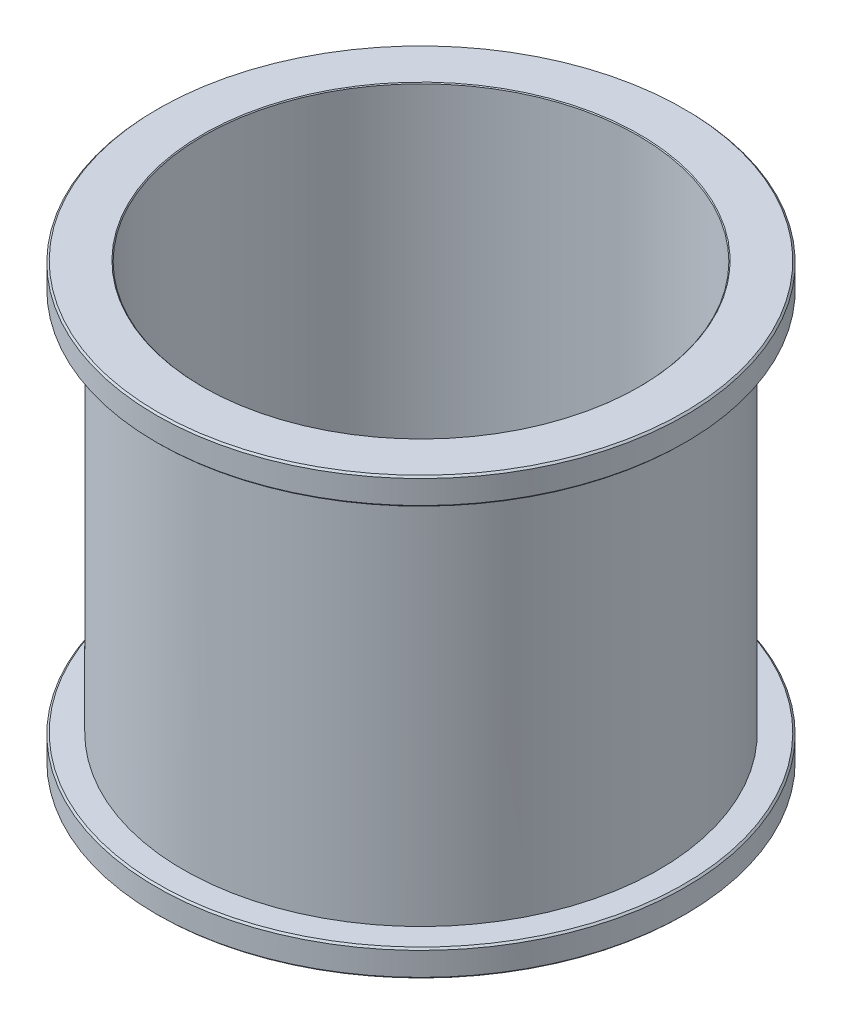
ISO-10303-21;
HEADER;
FILE_DESCRIPTION(('STEP AP214'),'2;1');
FILE_NAME('part.step','',(''),(''),'','','');
FILE_SCHEMA(('AUTOMOTIVE_DESIGN { 1 0 10303 214 1 1 1 1 }'));
ENDSEC;
DATA;
#1=APPLICATION_CONTEXT('core data for automotive mechanical design processes');
#2=APPLICATION_PROTOCOL_DEFINITION('international standard','automotive_design',2000,#1);
#3=PRODUCT_CONTEXT('',#1,'mechanical');
#4=PRODUCT('Part','Part','',(#3));
#5=PRODUCT_RELATED_PRODUCT_CATEGORY('part','',(#4));
#6=PRODUCT_DEFINITION_FORMATION('','',#4);
#7=PRODUCT_DEFINITION_CONTEXT('part definition',#1,'design');
#8=PRODUCT_DEFINITION('design','',#6,#7);
#9=PRODUCT_DEFINITION_SHAPE('','',#8);
#10=(LENGTH_UNIT() NAMED_UNIT(*) SI_UNIT(.MILLI.,.METRE.));
#11=(NAMED_UNIT(*) PLANE_ANGLE_UNIT() SI_UNIT($,.RADIAN.));
#12=(NAMED_UNIT(*) SI_UNIT($,.STERADIAN.) SOLID_ANGLE_UNIT());
#13=UNCERTAINTY_MEASURE_WITH_UNIT(LENGTH_MEASURE(1.E-05),#10,'distance_accuracy_value','');
#14=(GEOMETRIC_REPRESENTATION_CONTEXT(3) GLOBAL_UNCERTAINTY_ASSIGNED_CONTEXT((#13)) GLOBAL_UNIT_ASSIGNED_CONTEXT((#10,
#11,#12)) REPRESENTATION_CONTEXT('',''));
#15=CARTESIAN_POINT('',(0.,0.,0.));
#16=DIRECTION('',(0.,0.,1.));
#17=DIRECTION('',(1.,0.,0.));
#18=AXIS2_PLACEMENT_3D('',#15,#16,#17);
#19=CARTESIAN_POINT('',(0.,130.,0.));
#20=DIRECTION('',(0.,-1.,0.));
#21=DIRECTION('',(0.,0.,-1.));
#22=AXIS2_PLACEMENT_3D('',#19,#20,#21);
#23=CYLINDRICAL_SURFACE('',#22,71.);
#24=CARTESIAN_POINT('',(0.,122.,0.));
#25=DIRECTION('',(0.,1.,0.));
#26=DIRECTION('',(0.,0.,1.));
#27=AXIS2_PLACEMENT_3D('',#24,#25,#26);
#28=CIRCLE('',#27,71.);
#29=CARTESIAN_POINT('',(0.,122.,71.));
#30=VERTEX_POINT('',#29);
#31=EDGE_CURVE('E109',#30,#30,#28,.T.);
#32=ORIENTED_EDGE('',*,*,#31,.F.);
#33=EDGE_LOOP('',(#32));
#34=FACE_BOUND('',#33,.T.);
#35=CARTESIAN_POINT('',(0.,8.00000000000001,0.));
#36=DIRECTION('',(0.,-1.,0.));
#37=DIRECTION('',(0.,0.,-1.));
#38=AXIS2_PLACEMENT_3D('',#35,#36,#37);
#39=CIRCLE('',#38,71.);
#40=CARTESIAN_POINT('',(0.,8.00000000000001,-71.));
#41=VERTEX_POINT('',#40);
#42=EDGE_CURVE('E105',#41,#41,#39,.T.);
#43=ORIENTED_EDGE('',*,*,#42,.F.);
#44=EDGE_LOOP('',(#43));
#45=FACE_BOUND('',#44,.T.);
#46=ADVANCED_FACE('F47',(#34,#45),#23,.T.);
#47=CARTESIAN_POINT('',(0.,130.,0.));
#48=DIRECTION('',(0.,1.,0.));
#49=DIRECTION('',(0.,0.,1.));
#50=AXIS2_PLACEMENT_3D('',#47,#48,#49);
#51=PLANE('',#50);
#52=CARTESIAN_POINT('',(0.,130.,0.));
#53=DIRECTION('',(0.,1.,0.));
#54=DIRECTION('',(0.,0.,1.));
#55=AXIS2_PLACEMENT_3D('',#52,#53,#54);
#56=CIRCLE('',#55,65.254);
#57=CARTESIAN_POINT('',(0.,130.,65.254));
#58=VERTEX_POINT('',#57);
#59=EDGE_CURVE('E10',#58,#58,#56,.F.);
#60=ORIENTED_EDGE('',*,*,#59,.T.);
#61=EDGE_LOOP('',(#60));
#62=FACE_BOUND('',#61,.T.);
#63=CARTESIAN_POINT('',(0.,130.,0.));
#64=DIRECTION('',(0.,1.,0.));
#65=DIRECTION('',(0.,0.,1.));
#66=AXIS2_PLACEMENT_3D('',#63,#64,#65);
#67=CIRCLE('',#66,78.4919999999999);
#68=CARTESIAN_POINT('',(0.,130.,78.4919999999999));
#69=VERTEX_POINT('',#68);
#70=EDGE_CURVE('E85',#69,#69,#67,.T.);
#71=ORIENTED_EDGE('',*,*,#70,.T.);
#72=EDGE_LOOP('',(#71));
#73=FACE_BOUND('',#72,.T.);
#74=ADVANCED_FACE('F119',(#62,#73),#51,.T.);
#75=CARTESIAN_POINT('',(0.,0.,0.));
#76=DIRECTION('',(0.,1.,0.));
#77=DIRECTION('',(0.,0.,1.));
#78=AXIS2_PLACEMENT_3D('',#75,#76,#77);
#79=PLANE('',#78);
#80=CARTESIAN_POINT('',(0.,0.,0.));
#81=DIRECTION('',(0.,1.,0.));
#82=DIRECTION('',(0.,0.,1.));
#83=AXIS2_PLACEMENT_3D('',#80,#81,#82);
#84=CIRCLE('',#83,65.254);
#85=CARTESIAN_POINT('',(0.,0.,-65.254));
#86=VERTEX_POINT('',#85);
#87=EDGE_CURVE('E67',#86,#86,#84,.T.);
#88=ORIENTED_EDGE('',*,*,#87,.T.);
#89=EDGE_LOOP('',(#88));
#90=FACE_BOUND('',#89,.T.);
#91=CARTESIAN_POINT('',(0.,0.,0.));
#92=DIRECTION('',(0.,1.,0.));
#93=DIRECTION('',(0.,0.,1.));
#94=AXIS2_PLACEMENT_3D('',#91,#92,#93);
#95=CIRCLE('',#94,78.4919999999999);
#96=CARTESIAN_POINT('',(0.,0.,78.4919999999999));
#97=VERTEX_POINT('',#96);
#98=EDGE_CURVE('E101',#97,#97,#95,.F.);
#99=ORIENTED_EDGE('',*,*,#98,.T.);
#100=EDGE_LOOP('',(#99));
#101=FACE_BOUND('',#100,.T.);
#102=ADVANCED_FACE('F149',(#90,#101),#79,.F.);
#103=CARTESIAN_POINT('',(0.,130.,0.));
#104=DIRECTION('',(0.,-1.,0.));
#105=DIRECTION('',(0.,0.,-1.));
#106=AXIS2_PLACEMENT_3D('',#103,#104,#105);
#107=CYLINDRICAL_SURFACE('',#106,65.);
#108=CARTESIAN_POINT('',(0.,0.25400000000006,0.));
#109=DIRECTION('',(0.,1.,0.));
#110=DIRECTION('',(0.,0.,1.));
#111=AXIS2_PLACEMENT_3D('',#108,#109,#110);
#112=CIRCLE('',#111,65.);
#113=CARTESIAN_POINT('',(0.,0.25400000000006,-65.));
#114=VERTEX_POINT('',#113);
#115=EDGE_CURVE('E55',#114,#114,#112,.F.);
#116=ORIENTED_EDGE('',*,*,#115,.T.);
#117=EDGE_LOOP('',(#116));
#118=FACE_BOUND('',#117,.T.);
#119=CARTESIAN_POINT('',(0.,129.746,0.));
#120=DIRECTION('',(0.,1.,0.));
#121=DIRECTION('',(0.,0.,1.));
#122=AXIS2_PLACEMENT_3D('',#119,#120,#121);
#123=CIRCLE('',#122,65.);
#124=CARTESIAN_POINT('',(0.,129.746,65.));
#125=VERTEX_POINT('',#124);
#126=EDGE_CURVE('E61',#125,#125,#123,.T.);
#127=ORIENTED_EDGE('',*,*,#126,.T.);
#128=EDGE_LOOP('',(#127));
#129=FACE_BOUND('',#128,.T.);
#130=ADVANCED_FACE('F145',(#118,#129),#107,.F.);
#131=CARTESIAN_POINT('',(0.,122.,0.));
#132=DIRECTION('',(0.,1.,0.));
#133=DIRECTION('',(0.,0.,1.));
#134=AXIS2_PLACEMENT_3D('',#131,#132,#133);
#135=CYLINDRICAL_SURFACE('',#134,79.);
#136=CARTESIAN_POINT('',(0.,129.492,0.));
#137=DIRECTION('',(0.,1.,0.));
#138=DIRECTION('',(0.,0.,1.));
#139=AXIS2_PLACEMENT_3D('',#136,#137,#138);
#140=CIRCLE('',#139,79.);
#141=CARTESIAN_POINT('',(0.,129.492,79.));
#142=VERTEX_POINT('',#141);
#143=EDGE_CURVE('E77',#142,#142,#140,.F.);
#144=ORIENTED_EDGE('',*,*,#143,.T.);
#145=EDGE_LOOP('',(#144));
#146=FACE_BOUND('',#145,.T.);
#147=CARTESIAN_POINT('',(0.,122.508,0.));
#148=DIRECTION('',(0.,1.,0.));
#149=DIRECTION('',(0.,0.,1.));
#150=AXIS2_PLACEMENT_3D('',#147,#148,#149);
#151=CIRCLE('',#150,79.);
#152=CARTESIAN_POINT('',(0.,122.508,79.));
#153=VERTEX_POINT('',#152);
#154=EDGE_CURVE('E81',#153,#153,#151,.T.);
#155=ORIENTED_EDGE('',*,*,#154,.T.);
#156=EDGE_LOOP('',(#155));
#157=FACE_BOUND('',#156,.T.);
#158=ADVANCED_FACE('F141',(#146,#157),#135,.T.);
#159=CARTESIAN_POINT('',(0.,122.,0.));
#160=DIRECTION('',(0.,1.,0.));
#161=DIRECTION('',(0.,0.,1.));
#162=AXIS2_PLACEMENT_3D('',#159,#160,#161);
#163=PLANE('',#162);
#164=CARTESIAN_POINT('',(0.,122.,0.));
#165=DIRECTION('',(0.,1.,0.));
#166=DIRECTION('',(0.,0.,1.));
#167=AXIS2_PLACEMENT_3D('',#164,#165,#166);
#168=CIRCLE('',#167,78.492);
#169=CARTESIAN_POINT('',(0.,122.,78.492));
#170=VERTEX_POINT('',#169);
#171=EDGE_CURVE('E73',#170,#170,#168,.F.);
#172=ORIENTED_EDGE('',*,*,#171,.T.);
#173=EDGE_LOOP('',(#172));
#174=FACE_BOUND('',#173,.T.);
#175=ORIENTED_EDGE('',*,*,#31,.T.);
#176=EDGE_LOOP('',(#175));
#177=FACE_BOUND('',#176,.T.);
#178=ADVANCED_FACE('F115',(#174,#177),#163,.F.);
#179=CARTESIAN_POINT('',(0.,8.,0.));
#180=DIRECTION('',(0.,-1.,0.));
#181=DIRECTION('',(0.,0.,-1.));
#182=AXIS2_PLACEMENT_3D('',#179,#180,#181);
#183=CYLINDRICAL_SURFACE('',#182,79.);
#184=CARTESIAN_POINT('',(0.,0.508000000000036,0.));
#185=DIRECTION('',(0.,1.,0.));
#186=DIRECTION('',(0.,0.,1.));
#187=AXIS2_PLACEMENT_3D('',#184,#185,#186);
#188=CIRCLE('',#187,79.);
#189=CARTESIAN_POINT('',(0.,0.508000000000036,79.));
#190=VERTEX_POINT('',#189);
#191=EDGE_CURVE('E93',#190,#190,#188,.T.);
#192=ORIENTED_EDGE('',*,*,#191,.T.);
#193=EDGE_LOOP('',(#192));
#194=FACE_BOUND('',#193,.T.);
#195=CARTESIAN_POINT('',(0.,7.49200000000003,0.));
#196=DIRECTION('',(0.,-1.,0.));
#197=DIRECTION('',(0.,0.,-1.));
#198=AXIS2_PLACEMENT_3D('',#195,#196,#197);
#199=CIRCLE('',#198,79.);
#200=CARTESIAN_POINT('',(0.,7.49200000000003,-79.));
#201=VERTEX_POINT('',#200);
#202=EDGE_CURVE('E97',#201,#201,#199,.T.);
#203=ORIENTED_EDGE('',*,*,#202,.T.);
#204=EDGE_LOOP('',(#203));
#205=FACE_BOUND('',#204,.T.);
#206=ADVANCED_FACE('F126',(#194,#205),#183,.T.);
#207=CARTESIAN_POINT('',(0.,8.,0.));
#208=DIRECTION('',(0.,-1.,0.));
#209=DIRECTION('',(0.,0.,-1.));
#210=AXIS2_PLACEMENT_3D('',#207,#208,#209);
#211=PLANE('',#210);
#212=CARTESIAN_POINT('',(0.,8.,0.));
#213=DIRECTION('',(0.,-1.,0.));
#214=DIRECTION('',(0.,0.,-1.));
#215=AXIS2_PLACEMENT_3D('',#212,#213,#214);
#216=CIRCLE('',#215,78.492);
#217=CARTESIAN_POINT('',(0.,8.,-78.492));
#218=VERTEX_POINT('',#217);
#219=EDGE_CURVE('E89',#218,#218,#216,.F.);
#220=ORIENTED_EDGE('',*,*,#219,.T.);
#221=EDGE_LOOP('',(#220));
#222=FACE_BOUND('',#221,.T.);
#223=ORIENTED_EDGE('',*,*,#42,.T.);
#224=EDGE_LOOP('',(#223));
#225=FACE_BOUND('',#224,.T.);
#226=ADVANCED_FACE('F123',(#222,#225),#211,.F.);
#227=CARTESIAN_POINT('',(0.,0.,0.));
#228=DIRECTION('',(0.,1.,0.));
#229=DIRECTION('',(0.,0.,1.));
#230=AXIS2_PLACEMENT_3D('',#227,#228,#229);
#231=CONICAL_SURFACE('',#230,78.4919999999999,0.785398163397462);
#232=ORIENTED_EDGE('',*,*,#191,.F.);
#233=EDGE_LOOP('',(#232));
#234=FACE_BOUND('',#233,.T.);
#235=ORIENTED_EDGE('',*,*,#98,.F.);
#236=EDGE_LOOP('',(#235));
#237=FACE_BOUND('',#236,.T.);
#238=ADVANCED_FACE('F125',(#234,#237),#231,.T.);
#239=CARTESIAN_POINT('',(0.,7.49200000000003,0.));
#240=DIRECTION('',(0.,-1.,0.));
#241=DIRECTION('',(0.,0.,-1.));
#242=AXIS2_PLACEMENT_3D('',#239,#240,#241);
#243=CONICAL_SURFACE('',#242,79.,0.785398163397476);
#244=ORIENTED_EDGE('',*,*,#219,.F.);
#245=EDGE_LOOP('',(#244));
#246=FACE_BOUND('',#245,.T.);
#247=ORIENTED_EDGE('',*,*,#202,.F.);
#248=EDGE_LOOP('',(#247));
#249=FACE_BOUND('',#248,.T.);
#250=ADVANCED_FACE('F133',(#246,#249),#243,.T.);
#251=CARTESIAN_POINT('',(0.,130.,0.));
#252=DIRECTION('',(0.,-1.,0.));
#253=DIRECTION('',(0.,0.,-1.));
#254=AXIS2_PLACEMENT_3D('',#251,#252,#253);
#255=CONICAL_SURFACE('',#254,78.4919999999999,0.785398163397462);
#256=ORIENTED_EDGE('',*,*,#143,.F.);
#257=EDGE_LOOP('',(#256));
#258=FACE_BOUND('',#257,.T.);
#259=ORIENTED_EDGE('',*,*,#70,.F.);
#260=EDGE_LOOP('',(#259));
#261=FACE_BOUND('',#260,.T.);
#262=ADVANCED_FACE('F157',(#258,#261),#255,.T.);
#263=CARTESIAN_POINT('',(0.,122.508,0.));
#264=DIRECTION('',(0.,1.,0.));
#265=DIRECTION('',(0.,0.,1.));
#266=AXIS2_PLACEMENT_3D('',#263,#264,#265);
#267=CONICAL_SURFACE('',#266,79.,0.785398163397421);
#268=ORIENTED_EDGE('',*,*,#171,.F.);
#269=EDGE_LOOP('',(#268));
#270=FACE_BOUND('',#269,.T.);
#271=ORIENTED_EDGE('',*,*,#154,.F.);
#272=EDGE_LOOP('',(#271));
#273=FACE_BOUND('',#272,.T.);
#274=ADVANCED_FACE('F161',(#270,#273),#267,.T.);
#275=CARTESIAN_POINT('',(0.,0.,0.));
#276=DIRECTION('',(0.,-1.,0.));
#277=DIRECTION('',(0.,0.,-1.));
#278=AXIS2_PLACEMENT_3D('',#275,#276,#277);
#279=CONICAL_SURFACE('',#278,65.254,0.785398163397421);
#280=CARTESIAN_POINT('',(0.,0.25400000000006,-65.));
#281=CARTESIAN_POINT('',(0.,0.251354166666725,-65.0026458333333));
#282=CARTESIAN_POINT('',(0.,0.248708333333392,-65.0052916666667));
#283=CARTESIAN_POINT('',(0.,0.243416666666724,-65.0105833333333));
#284=CARTESIAN_POINT('',(0.,0.24077083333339,-65.0132291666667));
#285=CARTESIAN_POINT('',(0.,0.235479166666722,-65.0185208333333));
#286=CARTESIAN_POINT('',(0.,0.232833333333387,-65.0211666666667));
#287=CARTESIAN_POINT('',(0.,0.227541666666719,-65.0264583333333));
#288=CARTESIAN_POINT('',(0.,0.224895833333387,-65.0291041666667));
#289=CARTESIAN_POINT('',(0.,0.21960416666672,-65.0343958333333));
#290=CARTESIAN_POINT('',(0.,0.216958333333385,-65.0370416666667));
#291=CARTESIAN_POINT('',(0.,0.211666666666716,-65.0423333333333));
#292=CARTESIAN_POINT('',(0.,0.209020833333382,-65.0449791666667));
#293=CARTESIAN_POINT('',(0.,0.203729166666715,-65.0502708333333));
#294=CARTESIAN_POINT('',(0.,0.201083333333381,-65.0529166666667));
#295=CARTESIAN_POINT('',(0.,0.195791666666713,-65.0582083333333));
#296=CARTESIAN_POINT('',(0.,0.193145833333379,-65.0608541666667));
#297=CARTESIAN_POINT('',(0.,0.18785416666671,-65.0661458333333));
#298=CARTESIAN_POINT('',(0.,0.185208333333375,-65.0687916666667));
#299=CARTESIAN_POINT('',(0.,0.179916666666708,-65.0740833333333));
#300=CARTESIAN_POINT('',(0.,0.177270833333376,-65.0767291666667));
#301=CARTESIAN_POINT('',(0.,0.171979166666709,-65.0820208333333));
#302=CARTESIAN_POINT('',(0.,0.169333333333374,-65.0846666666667));
#303=CARTESIAN_POINT('',(0.,0.164041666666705,-65.0899583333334));
#304=CARTESIAN_POINT('',(0.,0.161395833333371,-65.0926041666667));
#305=CARTESIAN_POINT('',(0.,0.156104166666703,-65.0978958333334));
#306=CARTESIAN_POINT('',(0.,0.153458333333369,-65.1005416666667));
#307=CARTESIAN_POINT('',(0.,0.148166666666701,-65.1058333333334));
#308=CARTESIAN_POINT('',(0.,0.145520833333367,-65.1084791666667));
#309=CARTESIAN_POINT('',(0.,0.1402291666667,-65.1137708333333));
#310=CARTESIAN_POINT('',(0.,0.137583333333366,-65.1164166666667));
#311=CARTESIAN_POINT('',(0.,0.132291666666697,-65.1217083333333));
#312=CARTESIAN_POINT('',(0.,0.129645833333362,-65.1243541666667));
#313=CARTESIAN_POINT('',(0.,0.124354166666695,-65.1296458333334));
#314=CARTESIAN_POINT('',(0.,0.121708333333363,-65.1322916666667));
#315=CARTESIAN_POINT('',(0.,0.116416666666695,-65.1375833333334));
#316=CARTESIAN_POINT('',(0.,0.11377083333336,-65.1402291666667));
#317=CARTESIAN_POINT('',(0.,0.108479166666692,-65.1455208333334));
#318=CARTESIAN_POINT('',(0.,0.105833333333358,-65.1481666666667));
#319=CARTESIAN_POINT('',(0.,0.10054166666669,-65.1534583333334));
#320=CARTESIAN_POINT('',(0.,0.0978958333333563,-65.1561041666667));
#321=CARTESIAN_POINT('',(0.,0.0926041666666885,-65.1613958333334));
#322=CARTESIAN_POINT('',(0.,0.0899583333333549,-65.1640416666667));
#323=CARTESIAN_POINT('',(0.,0.0846666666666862,-65.1693333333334));
#324=CARTESIAN_POINT('',(0.,0.0820208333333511,-65.1719791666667));
#325=CARTESIAN_POINT('',(0.,0.0767291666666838,-65.1772708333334));
#326=CARTESIAN_POINT('',(0.,0.0740833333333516,-65.1799166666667));
#327=CARTESIAN_POINT('',(0.,0.0687916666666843,-65.1852083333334));
#328=CARTESIAN_POINT('',(0.,0.0661458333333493,-65.1878541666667));
#329=CARTESIAN_POINT('',(0.,0.0608541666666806,-65.1931458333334));
#330=CARTESIAN_POINT('',(0.,0.0582083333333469,-65.1957916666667));
#331=CARTESIAN_POINT('',(0.,0.0529166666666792,-65.2010833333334));
#332=CARTESIAN_POINT('',(0.,0.0502708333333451,-65.2037291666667));
#333=CARTESIAN_POINT('',(0.,0.0449791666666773,-65.2090208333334));
#334=CARTESIAN_POINT('',(0.,0.0423333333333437,-65.2116666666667));
#335=CARTESIAN_POINT('',(0.,0.037041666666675,-65.2169583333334));
#336=CARTESIAN_POINT('',(0.,0.03439583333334,-65.2196041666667));
#337=CARTESIAN_POINT('',(0.,0.0291041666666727,-65.2248958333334));
#338=CARTESIAN_POINT('',(0.,0.0264583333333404,-65.2275416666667));
#339=CARTESIAN_POINT('',(0.,0.0211666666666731,-65.2328333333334));
#340=CARTESIAN_POINT('',(0.,0.0185208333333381,-65.2354791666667));
#341=CARTESIAN_POINT('',(0.,0.0132291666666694,-65.2407708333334));
#342=CARTESIAN_POINT('',(0.,0.0105833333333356,-65.2434166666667));
#343=CARTESIAN_POINT('',(0.,0.00529166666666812,-65.2487083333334));
#344=CARTESIAN_POINT('',(0.,0.00264583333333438,-65.2513541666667));
#345=CARTESIAN_POINT('',(0.,0.,-65.254));
#346=B_SPLINE_CURVE_WITH_KNOTS('',3,(#280,#281,#282,#283,#284,#285,#286,#287,#288,#289,#290,
#291,#292,#293,#294,#295,#296,#297,#298,#299,#300,#301,#302,#303,#304,#305,#306,#307,#308,#309,
#310,#311,#312,#313,#314,#315,#316,#317,#318,#319,#320,#321,#322,#323,#324,#325,#326,#327,#328,
#329,#330,#331,#332,#333,#334,#335,#336,#337,#338,#339,#340,#341,#342,#343,#344,#345),
.UNSPECIFIED.,.F.,.F.,(4,2,2,2,2,2,2,2,2,2,2,2,2,2,2,2,2,2,2,2,2,2,2,2,2,2,2,2,2,2,2,2,4),(0.,
0.0112253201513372,0.0224506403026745,0.0336759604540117,0.0449012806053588,0.056126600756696,
0.0673519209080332,0.0785772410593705,0.0898025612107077,0.101027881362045,0.112253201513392,
0.123478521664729,0.134703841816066,0.145929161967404,0.157154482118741,0.168379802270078,
0.179605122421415,0.190830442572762,0.2020557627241,0.213281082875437,0.224506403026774,
0.235731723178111,0.246957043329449,0.258182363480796,0.269407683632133,0.28063300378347,
0.291858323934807,0.303083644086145,0.314308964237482,0.325534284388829,0.336759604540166,
0.347984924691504,0.359210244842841),.UNSPECIFIED.);
#347=EDGE_CURVE('BSEAM164',#114,#86,#346,.T.);
#348=ORIENTED_EDGE('',*,*,#115,.F.);
#349=ORIENTED_EDGE('',*,*,#87,.F.);
#350=ORIENTED_EDGE('',*,*,#347,.T.);
#351=ORIENTED_EDGE('',*,*,#347,.F.);
#352=EDGE_LOOP('',(#348,#350,#349,#351));
#353=FACE_BOUND('',#352,.T.);
#354=ADVANCED_FACE('F164',(#353),#279,.F.);
#355=CARTESIAN_POINT('',(0.,129.746,0.));
#356=DIRECTION('',(0.,1.,0.));
#357=DIRECTION('',(0.,0.,1.));
#358=AXIS2_PLACEMENT_3D('',#355,#356,#357);
#359=CONICAL_SURFACE('',#358,65.,0.785398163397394);
#360=ORIENTED_EDGE('',*,*,#59,.F.);
#361=EDGE_LOOP('',(#360));
#362=FACE_BOUND('',#361,.T.);
#363=ORIENTED_EDGE('',*,*,#126,.F.);
#364=EDGE_LOOP('',(#363));
#365=FACE_BOUND('',#364,.T.);
#366=ADVANCED_FACE('F49',(#362,#365),#359,.F.);
#367=CLOSED_SHELL('',(#46,#74,#102,#130,#158,#178,#206,#226,#238,#250,#262,#274,#354,#366));
#368=MANIFOLD_SOLID_BREP('B2',#367);
#369=ADVANCED_BREP_SHAPE_REPRESENTATION('',(#18,#368),#14);
#370=SHAPE_DEFINITION_REPRESENTATION(#9,#369);
ENDSEC;
END-ISO-10303-21;
